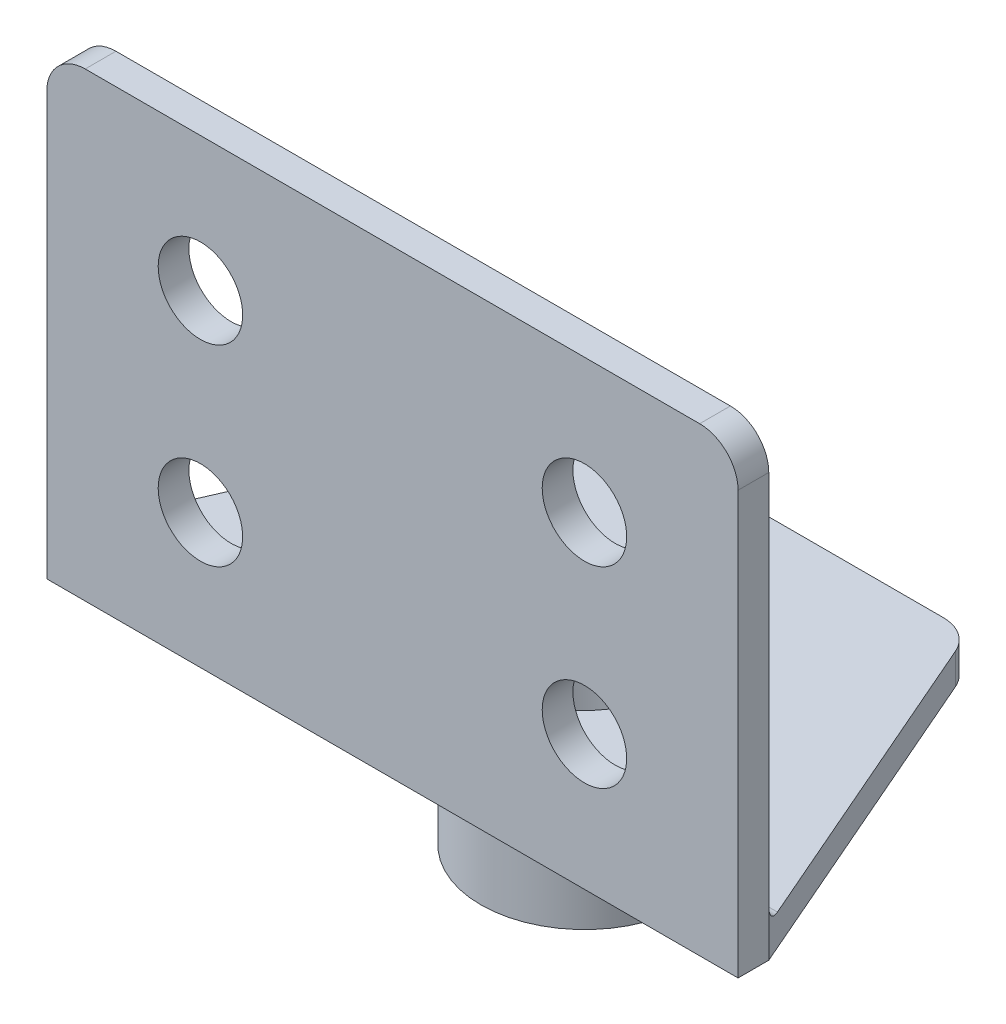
from build123d import *

# Parameters (mm, degrees)
BOSS_EXTRUDE1_DEPTH = 45
SKETCH2_R           = 12.5
CUT_EXTRUDE1_DEPTH  = 90
FILLET1_R           = 5
FILLET2_R           = 2
SKETCH3_R           = 13.5
SKETCH3_R_2         = 12.5
BOSS_EXTRUDE2_DEPTH = 20
FILLET3_R           = 2
SKETCH4_R           = 5.5
CUT_EXTRUDE2_DEPTH  = 25


with BuildPart() as part:
    # Sketch1 → Boss-Extrude1 (new, symmetric)
    with BuildSketch(Plane(origin=(0, 0, 0), x_dir=(0, 0, -1), z_dir=(1, 0, 0))):
        Polygon((-21, 4), (25, 4), (25, 0), (-25, 0), (-25, 60), (-21, 60), align=None)
    extrude(amount=BOSS_EXTRUDE1_DEPTH, both=True)

    # Sketch2 → Cut-Extrude1 (cut)
    with BuildSketch(Plane(origin=(0, 4, 0), x_dir=(1, 0, 0), z_dir=(0, 1, 0))):
        with Locations(Location((0, 0, 0), (0, 0, 270))):
            Circle(SKETCH2_R)
        with BuildLine():
            Line((-45, -21), (-26.307117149, 21.993630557))
            ThreePointArc((-26.307117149, 21.993630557), (-24.463285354, 24.181396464), (-21.721766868, 25))
            Line((-21.721766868, 25), (21.721766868, 25))
            ThreePointArc((21.721766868, 25), (24.463285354, 24.181396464), (26.307117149, 21.993630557))
            Line((26.307117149, 21.993630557), (45, -21))
            Line((45, -21), (81.943967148, -21))
            Line((81.943967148, -21), (81.943967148, 48.864905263))
            Line((81.943967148, 48.864905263), (-94.3966152, 48.864905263))
            Line((-94.3966152, 48.864905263), (-94.3966152, -21))
            Line((-94.3966152, -21), (-45, -21))
        make_face()
    extrude(amount=-CUT_EXTRUDE1_DEPTH, mode=Mode.SUBTRACT)

    # Fillet1
    fillet1_edges = [part.edges().sort_by_distance(p)[0] for p in [
        (45, 60, 23),
        (-45, 60, 23),
    ]]
    fillet(fillet1_edges, radius=FILLET1_R)

    # Fillet2
    fillet2_edges = [part.edges().sort_by_distance(p)[0] for p in [
        (0, 4, 21),
    ]]
    fillet(fillet2_edges, radius=FILLET2_R)

    # Sketch3 → Boss-Extrude2 (add)
    with BuildSketch(Plane.XZ):
        with Locations(Location((0, 0, 0), (0, 0, 90))):
            Circle(SKETCH3_R)
        with Locations(Location((0, 0, 0), (0, 0, 90))):
            Circle(SKETCH3_R_2, mode=Mode.SUBTRACT)
    extrude(amount=BOSS_EXTRUDE2_DEPTH)

    # Fillet3
    fillet3_edges = [part.edges().sort_by_distance(p)[0] for p in [
        (0, 0, -13.5),
    ]]
    fillet(fillet3_edges, radius=FILLET3_R)

    # Sketch4 → Cut-Extrude2 (cut)
    with BuildSketch(Plane(origin=(0, 0, 21), x_dir=(-1, 0, 0), z_dir=(0, 0, -1))):
        with Locations((-25, 42.5)):
            Circle(SKETCH4_R)
        with Locations((25, 42.5)):
            Circle(SKETCH4_R)
        with Locations((25, 17.5)):
            Circle(SKETCH4_R)
        with Locations((-25, 17.5)):
            Circle(SKETCH4_R)
    extrude(amount=-CUT_EXTRUDE2_DEPTH, mode=Mode.SUBTRACT)


solid = part.part
